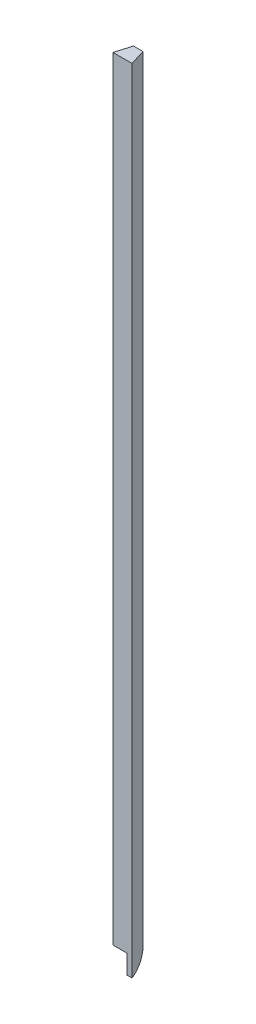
from build123d import *

# Parameters (mm, degrees)
BOSS_EXTRUDE1_DEPTH = 635
CUT_EXTRUDE2_DEPTH  = 15.24
CUT_EXTRUDE3_DEPTH  = 15.24


with BuildPart() as part:
    # Sketch1 → Boss-Extrude1 (new body)
    with BuildSketch(Plane(origin=(0, 0, 0), x_dir=(1, 0, 0), z_dir=(0, 1, 0))):
        Polygon((-7.62, 0), (7.62, 0), (3.81, 12.7), (-3.81, 12.7), align=None)
    extrude(amount=BOSS_EXTRUDE1_DEPTH)

    # Sketch3 → Cut-Extrude2 (cut)
    with BuildSketch(Plane(origin=(0, 0, 0), x_dir=(-1, 0, 0), z_dir=(0, -1, 0))):
        Polygon((7.62, 0), (3.81, 12.7), (-3.81, 12.7), (-3.81, 0), align=None)
    extrude(amount=-CUT_EXTRUDE2_DEPTH, mode=Mode.SUBTRACT)

    # Sketch4 → Cut-Extrude3 (cut)
    with BuildSketch(Plane.ZY.offset(-3.81)):
        with BuildLine():
            Line((-12.7, 0), (0, 0))
            ThreePointArc((0, 0), (-8.649017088, 4.050982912), (-12.7, 12.7))
            Line((-12.7, 12.7), (-12.7, 0))
        make_face()
    extrude(amount=-CUT_EXTRUDE3_DEPTH, mode=Mode.SUBTRACT)


solid = part.part
